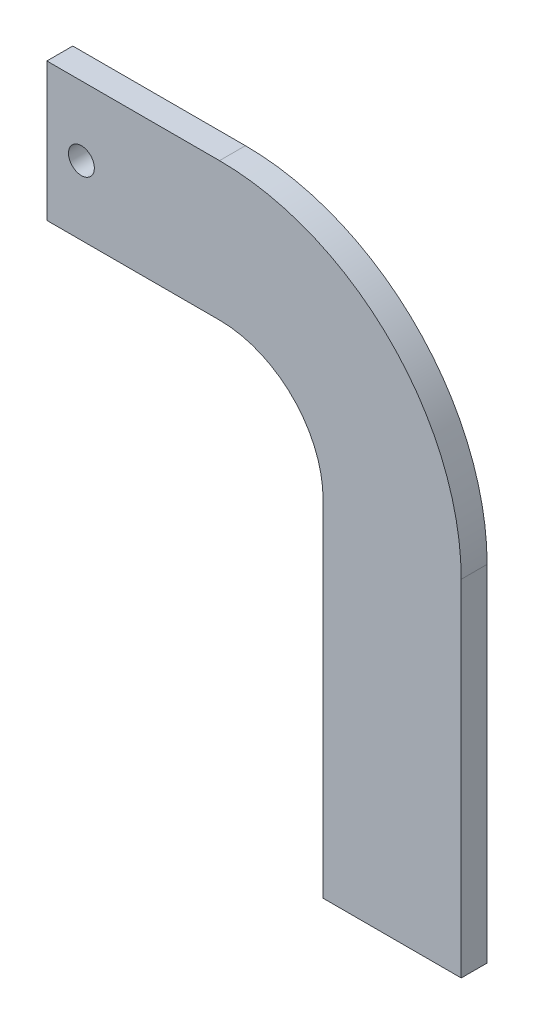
ISO-10303-21;
HEADER;
FILE_DESCRIPTION(('STEP AP214'),'2;1');
FILE_NAME('part.step','',(''),(''),'','','');
FILE_SCHEMA(('AUTOMOTIVE_DESIGN { 1 0 10303 214 1 1 1 1 }'));
ENDSEC;
DATA;
#1=APPLICATION_CONTEXT('core data for automotive mechanical design processes');
#2=APPLICATION_PROTOCOL_DEFINITION('international standard','automotive_design',2000,#1);
#3=PRODUCT_CONTEXT('',#1,'mechanical');
#4=PRODUCT('Part','Part','',(#3));
#5=PRODUCT_RELATED_PRODUCT_CATEGORY('part','',(#4));
#6=PRODUCT_DEFINITION_FORMATION('','',#4);
#7=PRODUCT_DEFINITION_CONTEXT('part definition',#1,'design');
#8=PRODUCT_DEFINITION('design','',#6,#7);
#9=PRODUCT_DEFINITION_SHAPE('','',#8);
#10=(LENGTH_UNIT() NAMED_UNIT(*) SI_UNIT(.MILLI.,.METRE.));
#11=(NAMED_UNIT(*) PLANE_ANGLE_UNIT() SI_UNIT($,.RADIAN.));
#12=(NAMED_UNIT(*) SI_UNIT($,.STERADIAN.) SOLID_ANGLE_UNIT());
#13=UNCERTAINTY_MEASURE_WITH_UNIT(LENGTH_MEASURE(1.E-05),#10,'distance_accuracy_value','');
#14=(GEOMETRIC_REPRESENTATION_CONTEXT(3) GLOBAL_UNCERTAINTY_ASSIGNED_CONTEXT((#13)) GLOBAL_UNIT_ASSIGNED_CONTEXT((#10,
#11,#12)) REPRESENTATION_CONTEXT('',''));
#15=CARTESIAN_POINT('',(0.,0.,0.));
#16=DIRECTION('',(0.,0.,1.));
#17=DIRECTION('',(1.,0.,0.));
#18=AXIS2_PLACEMENT_3D('',#15,#16,#17);
#19=CARTESIAN_POINT('',(-76.2,254.,19.05));
#20=DIRECTION('',(0.,0.,1.));
#21=DIRECTION('',(1.,0.,0.));
#22=AXIS2_PLACEMENT_3D('',#19,#20,#21);
#23=PLANE('',#22);
#24=DIRECTION('',(0.,-1.,0.));
#25=VECTOR('',#24,1.);
#26=CARTESIAN_POINT('',(0.,0.,19.05));
#27=LINE('',#26,#25);
#28=CARTESIAN_POINT('',(0.,254.,19.05));
#29=VERTEX_POINT('',#28);
#30=CARTESIAN_POINT('',(0.,0.,19.05));
#31=VERTEX_POINT('',#30);
#32=EDGE_CURVE('E142',#29,#31,#27,.T.);
#33=ORIENTED_EDGE('',*,*,#32,.T.);
#34=DIRECTION('',(1.,0.,0.));
#35=VECTOR('',#34,1.);
#36=CARTESIAN_POINT('',(0.,0.,19.05));
#37=LINE('',#36,#35);
#38=CARTESIAN_POINT('',(101.6,0.,19.05));
#39=VERTEX_POINT('',#38);
#40=EDGE_CURVE('E90',#31,#39,#37,.T.);
#41=ORIENTED_EDGE('',*,*,#40,.T.);
#42=DIRECTION('',(0.,1.,0.));
#43=VECTOR('',#42,1.);
#44=CARTESIAN_POINT('',(101.6,0.,19.05));
#45=LINE('',#44,#43);
#46=CARTESIAN_POINT('',(101.6,254.,19.05));
#47=VERTEX_POINT('',#46);
#48=EDGE_CURVE('E157',#39,#47,#45,.T.);
#49=ORIENTED_EDGE('',*,*,#48,.T.);
#50=CARTESIAN_POINT('',(-76.2,254.,19.05));
#51=DIRECTION('',(0.,0.,1.));
#52=DIRECTION('',(1.,0.,0.));
#53=AXIS2_PLACEMENT_3D('',#50,#51,#52);
#54=CIRCLE('',#53,177.8);
#55=CARTESIAN_POINT('',(-76.2000000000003,431.8,19.05));
#56=VERTEX_POINT('',#55);
#57=EDGE_CURVE('E170',#47,#56,#54,.T.);
#58=ORIENTED_EDGE('',*,*,#57,.T.);
#59=DIRECTION('',(-1.,0.,0.));
#60=VECTOR('',#59,1.);
#61=CARTESIAN_POINT('',(-203.2,431.8,19.05));
#62=LINE('',#61,#60);
#63=CARTESIAN_POINT('',(-203.2,431.8,19.05));
#64=VERTEX_POINT('',#63);
#65=EDGE_CURVE('E109',#56,#64,#62,.T.);
#66=ORIENTED_EDGE('',*,*,#65,.T.);
#67=DIRECTION('',(0.,-1.,0.));
#68=VECTOR('',#67,1.);
#69=CARTESIAN_POINT('',(-203.2,330.2,19.05));
#70=LINE('',#69,#68);
#71=CARTESIAN_POINT('',(-203.2,330.2,19.05));
#72=VERTEX_POINT('',#71);
#73=EDGE_CURVE('E103',#64,#72,#70,.T.);
#74=ORIENTED_EDGE('',*,*,#73,.T.);
#75=DIRECTION('',(1.,0.,0.));
#76=VECTOR('',#75,1.);
#77=CARTESIAN_POINT('',(-76.2,330.2,19.05));
#78=LINE('',#77,#76);
#79=CARTESIAN_POINT('',(-76.2,330.2,19.05));
#80=VERTEX_POINT('',#79);
#81=EDGE_CURVE('E107',#72,#80,#78,.T.);
#82=ORIENTED_EDGE('',*,*,#81,.T.);
#83=CARTESIAN_POINT('',(-76.2,254.,19.05));
#84=DIRECTION('',(0.,0.,-1.));
#85=DIRECTION('',(1.,0.,0.));
#86=AXIS2_PLACEMENT_3D('',#83,#84,#85);
#87=CIRCLE('',#86,76.2);
#88=EDGE_CURVE('E47',#80,#29,#87,.T.);
#89=ORIENTED_EDGE('',*,*,#88,.T.);
#90=EDGE_LOOP('',(#33,#41,#49,#58,#66,#74,#82,#89));
#91=FACE_BOUND('',#90,.T.);
#92=CARTESIAN_POINT('',(-177.8,381.,19.05));
#93=DIRECTION('',(0.,0.,1.));
#94=DIRECTION('',(1.,0.,0.));
#95=AXIS2_PLACEMENT_3D('',#92,#93,#94);
#96=CIRCLE('',#95,9.52499999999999);
#97=CARTESIAN_POINT('',(-187.325,381.,19.05));
#98=VERTEX_POINT('',#97);
#99=EDGE_CURVE('E131',#98,#98,#96,.T.);
#100=ORIENTED_EDGE('',*,*,#99,.F.);
#101=EDGE_LOOP('',(#100));
#102=FACE_BOUND('',#101,.T.);
#103=ADVANCED_FACE('F30',(#91,#102),#23,.T.);
#104=CARTESIAN_POINT('',(-76.2,254.,0.));
#105=DIRECTION('',(0.,0.,1.));
#106=DIRECTION('',(1.,0.,0.));
#107=AXIS2_PLACEMENT_3D('',#104,#105,#106);
#108=PLANE('',#107);
#109=DIRECTION('',(0.,-1.,0.));
#110=VECTOR('',#109,1.);
#111=CARTESIAN_POINT('',(0.,0.,0.));
#112=LINE('',#111,#110);
#113=CARTESIAN_POINT('',(0.,254.,0.));
#114=VERTEX_POINT('',#113);
#115=CARTESIAN_POINT('',(0.,0.,0.));
#116=VERTEX_POINT('',#115);
#117=EDGE_CURVE('E127',#114,#116,#112,.T.);
#118=ORIENTED_EDGE('',*,*,#117,.F.);
#119=CARTESIAN_POINT('',(-76.2,254.,0.));
#120=DIRECTION('',(0.,0.,-1.));
#121=DIRECTION('',(1.,0.,0.));
#122=AXIS2_PLACEMENT_3D('',#119,#120,#121);
#123=CIRCLE('',#122,76.2);
#124=CARTESIAN_POINT('',(-76.2,330.2,0.));
#125=VERTEX_POINT('',#124);
#126=EDGE_CURVE('E82',#125,#114,#123,.T.);
#127=ORIENTED_EDGE('',*,*,#126,.F.);
#128=DIRECTION('',(1.,0.,0.));
#129=VECTOR('',#128,1.);
#130=CARTESIAN_POINT('',(-76.2,330.2,0.));
#131=LINE('',#130,#129);
#132=CARTESIAN_POINT('',(-203.2,330.2,0.));
#133=VERTEX_POINT('',#132);
#134=EDGE_CURVE('E76',#133,#125,#131,.T.);
#135=ORIENTED_EDGE('',*,*,#134,.F.);
#136=DIRECTION('',(0.,-1.,0.));
#137=VECTOR('',#136,1.);
#138=CARTESIAN_POINT('',(-203.2,330.2,0.));
#139=LINE('',#138,#137);
#140=CARTESIAN_POINT('',(-203.2,431.8,0.));
#141=VERTEX_POINT('',#140);
#142=EDGE_CURVE('E117',#141,#133,#139,.T.);
#143=ORIENTED_EDGE('',*,*,#142,.F.);
#144=DIRECTION('',(-1.,0.,0.));
#145=VECTOR('',#144,1.);
#146=CARTESIAN_POINT('',(-203.2,431.8,0.));
#147=LINE('',#146,#145);
#148=CARTESIAN_POINT('',(-76.2000000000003,431.8,0.));
#149=VERTEX_POINT('',#148);
#150=EDGE_CURVE('E137',#149,#141,#147,.T.);
#151=ORIENTED_EDGE('',*,*,#150,.F.);
#152=CARTESIAN_POINT('',(-76.2,254.,0.));
#153=DIRECTION('',(0.,0.,1.));
#154=DIRECTION('',(1.,0.,0.));
#155=AXIS2_PLACEMENT_3D('',#152,#153,#154);
#156=CIRCLE('',#155,177.8);
#157=CARTESIAN_POINT('',(101.6,254.,0.));
#158=VERTEX_POINT('',#157);
#159=EDGE_CURVE('E135',#158,#149,#156,.T.);
#160=ORIENTED_EDGE('',*,*,#159,.F.);
#161=DIRECTION('',(0.,1.,0.));
#162=VECTOR('',#161,1.);
#163=CARTESIAN_POINT('',(101.6,0.,0.));
#164=LINE('',#163,#162);
#165=CARTESIAN_POINT('',(101.6,0.,0.));
#166=VERTEX_POINT('',#165);
#167=EDGE_CURVE('E133',#166,#158,#164,.T.);
#168=ORIENTED_EDGE('',*,*,#167,.F.);
#169=DIRECTION('',(1.,0.,0.));
#170=VECTOR('',#169,1.);
#171=CARTESIAN_POINT('',(0.,0.,0.));
#172=LINE('',#171,#170);
#173=EDGE_CURVE('E130',#116,#166,#172,.T.);
#174=ORIENTED_EDGE('',*,*,#173,.F.);
#175=EDGE_LOOP('',(#118,#127,#135,#143,#151,#160,#168,#174));
#176=FACE_BOUND('',#175,.T.);
#177=CARTESIAN_POINT('',(-177.8,381.,0.));
#178=DIRECTION('',(0.,0.,1.));
#179=DIRECTION('',(1.,0.,0.));
#180=AXIS2_PLACEMENT_3D('',#177,#178,#179);
#181=CIRCLE('',#180,9.52499999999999);
#182=CARTESIAN_POINT('',(-187.325,381.,0.));
#183=VERTEX_POINT('',#182);
#184=EDGE_CURVE('E176',#183,#183,#181,.T.);
#185=ORIENTED_EDGE('',*,*,#184,.T.);
#186=EDGE_LOOP('',(#185));
#187=FACE_BOUND('',#186,.T.);
#188=ADVANCED_FACE('F161',(#176,#187),#108,.F.);
#189=CARTESIAN_POINT('',(0.,0.,19.05));
#190=DIRECTION('',(1.,0.,0.));
#191=DIRECTION('',(0.,0.,-1.));
#192=AXIS2_PLACEMENT_3D('',#189,#190,#191);
#193=PLANE('',#192);
#194=ORIENTED_EDGE('',*,*,#117,.T.);
#195=DIRECTION('',(0.,0.,-1.));
#196=VECTOR('',#195,1.);
#197=CARTESIAN_POINT('',(0.,0.,19.05));
#198=LINE('',#197,#196);
#199=EDGE_CURVE('E11',#31,#116,#198,.T.);
#200=ORIENTED_EDGE('',*,*,#199,.F.);
#201=ORIENTED_EDGE('',*,*,#32,.F.);
#202=DIRECTION('',(0.,0.,-1.));
#203=VECTOR('',#202,1.);
#204=CARTESIAN_POINT('',(0.,254.,19.05));
#205=LINE('',#204,#203);
#206=EDGE_CURVE('E123',#29,#114,#205,.T.);
#207=ORIENTED_EDGE('',*,*,#206,.T.);
#208=EDGE_LOOP('',(#194,#200,#201,#207));
#209=FACE_BOUND('',#208,.T.);
#210=ADVANCED_FACE('F32',(#209),#193,.F.);
#211=CARTESIAN_POINT('',(0.,0.,19.05));
#212=DIRECTION('',(0.,1.,0.));
#213=DIRECTION('',(0.,0.,1.));
#214=AXIS2_PLACEMENT_3D('',#211,#212,#213);
#215=PLANE('',#214);
#216=ORIENTED_EDGE('',*,*,#173,.T.);
#217=DIRECTION('',(0.,0.,-1.));
#218=VECTOR('',#217,1.);
#219=CARTESIAN_POINT('',(101.6,0.,19.05));
#220=LINE('',#219,#218);
#221=EDGE_CURVE('E39',#39,#166,#220,.T.);
#222=ORIENTED_EDGE('',*,*,#221,.F.);
#223=ORIENTED_EDGE('',*,*,#40,.F.);
#224=ORIENTED_EDGE('',*,*,#199,.T.);
#225=EDGE_LOOP('',(#216,#222,#223,#224));
#226=FACE_BOUND('',#225,.T.);
#227=ADVANCED_FACE('F204',(#226),#215,.F.);
#228=CARTESIAN_POINT('',(101.6,0.,19.05));
#229=DIRECTION('',(-1.,0.,0.));
#230=DIRECTION('',(0.,0.,1.));
#231=AXIS2_PLACEMENT_3D('',#228,#229,#230);
#232=PLANE('',#231);
#233=ORIENTED_EDGE('',*,*,#167,.T.);
#234=DIRECTION('',(0.,0.,-1.));
#235=VECTOR('',#234,1.);
#236=CARTESIAN_POINT('',(101.6,254.,19.05));
#237=LINE('',#236,#235);
#238=EDGE_CURVE('E149',#47,#158,#237,.T.);
#239=ORIENTED_EDGE('',*,*,#238,.F.);
#240=ORIENTED_EDGE('',*,*,#48,.F.);
#241=ORIENTED_EDGE('',*,*,#221,.T.);
#242=EDGE_LOOP('',(#233,#239,#240,#241));
#243=FACE_BOUND('',#242,.T.);
#244=ADVANCED_FACE('F155',(#243),#232,.F.);
#245=CARTESIAN_POINT('',(-76.2,254.,19.05));
#246=DIRECTION('',(0.,0.,-1.));
#247=DIRECTION('',(-1.,0.,0.));
#248=AXIS2_PLACEMENT_3D('',#245,#246,#247);
#249=CYLINDRICAL_SURFACE('',#248,177.8);
#250=ORIENTED_EDGE('',*,*,#159,.T.);
#251=DIRECTION('',(0.,0.,-1.));
#252=VECTOR('',#251,1.);
#253=CARTESIAN_POINT('',(-76.2000000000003,431.8,19.05));
#254=LINE('',#253,#252);
#255=EDGE_CURVE('E146',#56,#149,#254,.T.);
#256=ORIENTED_EDGE('',*,*,#255,.F.);
#257=ORIENTED_EDGE('',*,*,#57,.F.);
#258=ORIENTED_EDGE('',*,*,#238,.T.);
#259=EDGE_LOOP('',(#250,#256,#257,#258));
#260=FACE_BOUND('',#259,.T.);
#261=ADVANCED_FACE('F166',(#260),#249,.T.);
#262=CARTESIAN_POINT('',(-203.2,431.8,19.05));
#263=DIRECTION('',(0.,-1.,0.));
#264=DIRECTION('',(0.,0.,-1.));
#265=AXIS2_PLACEMENT_3D('',#262,#263,#264);
#266=PLANE('',#265);
#267=ORIENTED_EDGE('',*,*,#150,.T.);
#268=DIRECTION('',(0.,0.,-1.));
#269=VECTOR('',#268,1.);
#270=CARTESIAN_POINT('',(-203.2,431.8,19.05));
#271=LINE('',#270,#269);
#272=EDGE_CURVE('E118',#64,#141,#271,.T.);
#273=ORIENTED_EDGE('',*,*,#272,.F.);
#274=ORIENTED_EDGE('',*,*,#65,.F.);
#275=ORIENTED_EDGE('',*,*,#255,.T.);
#276=EDGE_LOOP('',(#267,#273,#274,#275));
#277=FACE_BOUND('',#276,.T.);
#278=ADVANCED_FACE('F169',(#277),#266,.F.);
#279=CARTESIAN_POINT('',(-203.2,330.2,19.05));
#280=DIRECTION('',(1.,0.,0.));
#281=DIRECTION('',(0.,0.,-1.));
#282=AXIS2_PLACEMENT_3D('',#279,#280,#281);
#283=PLANE('',#282);
#284=ORIENTED_EDGE('',*,*,#142,.T.);
#285=DIRECTION('',(0.,0.,-1.));
#286=VECTOR('',#285,1.);
#287=CARTESIAN_POINT('',(-203.2,330.2,19.05));
#288=LINE('',#287,#286);
#289=EDGE_CURVE('E114',#72,#133,#288,.T.);
#290=ORIENTED_EDGE('',*,*,#289,.F.);
#291=ORIENTED_EDGE('',*,*,#73,.F.);
#292=ORIENTED_EDGE('',*,*,#272,.T.);
#293=EDGE_LOOP('',(#284,#290,#291,#292));
#294=FACE_BOUND('',#293,.T.);
#295=ADVANCED_FACE('F115',(#294),#283,.F.);
#296=CARTESIAN_POINT('',(-76.2,330.2,19.05));
#297=DIRECTION('',(0.,1.,0.));
#298=DIRECTION('',(-1.,0.,0.));
#299=AXIS2_PLACEMENT_3D('',#296,#297,#298);
#300=PLANE('',#299);
#301=ORIENTED_EDGE('',*,*,#134,.T.);
#302=DIRECTION('',(0.,0.,-1.));
#303=VECTOR('',#302,1.);
#304=CARTESIAN_POINT('',(-76.2,330.2,19.05));
#305=LINE('',#304,#303);
#306=EDGE_CURVE('E119',#80,#125,#305,.T.);
#307=ORIENTED_EDGE('',*,*,#306,.F.);
#308=ORIENTED_EDGE('',*,*,#81,.F.);
#309=ORIENTED_EDGE('',*,*,#289,.T.);
#310=EDGE_LOOP('',(#301,#307,#308,#309));
#311=FACE_BOUND('',#310,.T.);
#312=ADVANCED_FACE('F121',(#311),#300,.F.);
#313=CARTESIAN_POINT('',(-76.2,254.,19.05));
#314=DIRECTION('',(0.,0.,-1.));
#315=DIRECTION('',(-1.,0.,0.));
#316=AXIS2_PLACEMENT_3D('',#313,#314,#315);
#317=CYLINDRICAL_SURFACE('',#316,76.2);
#318=ORIENTED_EDGE('',*,*,#126,.T.);
#319=ORIENTED_EDGE('',*,*,#206,.F.);
#320=ORIENTED_EDGE('',*,*,#88,.F.);
#321=ORIENTED_EDGE('',*,*,#306,.T.);
#322=EDGE_LOOP('',(#318,#319,#320,#321));
#323=FACE_BOUND('',#322,.T.);
#324=ADVANCED_FACE('F192',(#323),#317,.F.);
#325=CARTESIAN_POINT('',(-177.8,381.,19.05));
#326=DIRECTION('',(0.,0.,-1.));
#327=DIRECTION('',(-1.,0.,0.));
#328=AXIS2_PLACEMENT_3D('',#325,#326,#327);
#329=CYLINDRICAL_SURFACE('',#328,9.52499999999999);
#330=CARTESIAN_POINT('',(-187.325,381.,19.05));
#331=CARTESIAN_POINT('',(-187.325,381.,18.8515625));
#332=CARTESIAN_POINT('',(-187.325,381.,18.653125));
#333=CARTESIAN_POINT('',(-187.325,381.,18.25625));
#334=CARTESIAN_POINT('',(-187.325,381.,18.0578125));
#335=CARTESIAN_POINT('',(-187.325,381.,17.6609375));
#336=CARTESIAN_POINT('',(-187.325,381.,17.4625));
#337=CARTESIAN_POINT('',(-187.325,381.,17.065625));
#338=CARTESIAN_POINT('',(-187.325,381.,16.8671875));
#339=CARTESIAN_POINT('',(-187.325,381.,16.4703125));
#340=CARTESIAN_POINT('',(-187.325,381.,16.271875));
#341=CARTESIAN_POINT('',(-187.325,381.,15.875));
#342=CARTESIAN_POINT('',(-187.325,381.,15.6765625));
#343=CARTESIAN_POINT('',(-187.325,381.,15.2796875));
#344=CARTESIAN_POINT('',(-187.325,381.,15.08125));
#345=CARTESIAN_POINT('',(-187.325,381.,14.684375));
#346=CARTESIAN_POINT('',(-187.325,381.,14.4859375));
#347=CARTESIAN_POINT('',(-187.325,381.,14.0890625));
#348=CARTESIAN_POINT('',(-187.325,381.,13.890625));
#349=CARTESIAN_POINT('',(-187.325,381.,13.49375));
#350=CARTESIAN_POINT('',(-187.325,381.,13.2953125));
#351=CARTESIAN_POINT('',(-187.325,381.,12.8984375));
#352=CARTESIAN_POINT('',(-187.325,381.,12.7));
#353=CARTESIAN_POINT('',(-187.325,381.,12.303125));
#354=CARTESIAN_POINT('',(-187.325,381.,12.1046875));
#355=CARTESIAN_POINT('',(-187.325,381.,11.7078125));
#356=CARTESIAN_POINT('',(-187.325,381.,11.509375));
#357=CARTESIAN_POINT('',(-187.325,381.,11.1125));
#358=CARTESIAN_POINT('',(-187.325,381.,10.9140625));
#359=CARTESIAN_POINT('',(-187.325,381.,10.5171875));
#360=CARTESIAN_POINT('',(-187.325,381.,10.31875));
#361=CARTESIAN_POINT('',(-187.325,381.,9.921875));
#362=CARTESIAN_POINT('',(-187.325,381.,9.7234375));
#363=CARTESIAN_POINT('',(-187.325,381.,9.3265625));
#364=CARTESIAN_POINT('',(-187.325,381.,9.128125));
#365=CARTESIAN_POINT('',(-187.325,381.,8.73125));
#366=CARTESIAN_POINT('',(-187.325,381.,8.5328125));
#367=CARTESIAN_POINT('',(-187.325,381.,8.1359375));
#368=CARTESIAN_POINT('',(-187.325,381.,7.9375));
#369=CARTESIAN_POINT('',(-187.325,381.,7.540625));
#370=CARTESIAN_POINT('',(-187.325,381.,7.3421875));
#371=CARTESIAN_POINT('',(-187.325,381.,6.9453125));
#372=CARTESIAN_POINT('',(-187.325,381.,6.746875));
#373=CARTESIAN_POINT('',(-187.325,381.,6.35));
#374=CARTESIAN_POINT('',(-187.325,381.,6.1515625));
#375=CARTESIAN_POINT('',(-187.325,381.,5.7546875));
#376=CARTESIAN_POINT('',(-187.325,381.,5.55625));
#377=CARTESIAN_POINT('',(-187.325,381.,5.159375));
#378=CARTESIAN_POINT('',(-187.325,381.,4.9609375));
#379=CARTESIAN_POINT('',(-187.325,381.,4.5640625));
#380=CARTESIAN_POINT('',(-187.325,381.,4.365625));
#381=CARTESIAN_POINT('',(-187.325,381.,3.96875));
#382=CARTESIAN_POINT('',(-187.325,381.,3.7703125));
#383=CARTESIAN_POINT('',(-187.325,381.,3.3734375));
#384=CARTESIAN_POINT('',(-187.325,381.,3.175));
#385=CARTESIAN_POINT('',(-187.325,381.,2.778125));
#386=CARTESIAN_POINT('',(-187.325,381.,2.5796875));
#387=CARTESIAN_POINT('',(-187.325,381.,2.1828125));
#388=CARTESIAN_POINT('',(-187.325,381.,1.984375));
#389=CARTESIAN_POINT('',(-187.325,381.,1.5875));
#390=CARTESIAN_POINT('',(-187.325,381.,1.3890625));
#391=CARTESIAN_POINT('',(-187.325,381.,0.992187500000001));
#392=CARTESIAN_POINT('',(-187.325,381.,0.793750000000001));
#393=CARTESIAN_POINT('',(-187.325,381.,0.396875));
#394=CARTESIAN_POINT('',(-187.325,381.,0.1984375));
#395=CARTESIAN_POINT('',(-187.325,381.,0.));
#396=B_SPLINE_CURVE_WITH_KNOTS('',3,(#330,#331,#332,#333,#334,#335,#336,#337,#338,#339,#340,
#341,#342,#343,#344,#345,#346,#347,#348,#349,#350,#351,#352,#353,#354,#355,#356,#357,#358,#359,
#360,#361,#362,#363,#364,#365,#366,#367,#368,#369,#370,#371,#372,#373,#374,#375,#376,#377,#378,
#379,#380,#381,#382,#383,#384,#385,#386,#387,#388,#389,#390,#391,#392,#393,#394,#395),
.UNSPECIFIED.,.F.,.F.,(4,2,2,2,2,2,2,2,2,2,2,2,2,2,2,2,2,2,2,2,2,2,2,2,2,2,2,2,2,2,2,2,4),(0.,
0.5953125,1.190625,1.7859375,2.38125,2.9765625,3.571875,4.1671875,4.7625,5.3578125,5.953125,
6.5484375,7.14375,7.7390625,8.334375,8.9296875,9.525,10.1203125,10.715625,11.3109375,11.90625,
12.5015625,13.096875,13.6921875,14.2875,14.8828125,15.478125,16.0734375,16.66875,17.2640625,
17.859375,18.4546875,19.05),.UNSPECIFIED.);
#397=EDGE_CURVE('BSEAM182',#98,#183,#396,.T.);
#398=ORIENTED_EDGE('',*,*,#99,.T.);
#399=ORIENTED_EDGE('',*,*,#184,.F.);
#400=ORIENTED_EDGE('',*,*,#397,.T.);
#401=ORIENTED_EDGE('',*,*,#397,.F.);
#402=EDGE_LOOP('',(#398,#400,#399,#401));
#403=FACE_BOUND('',#402,.T.);
#404=ADVANCED_FACE('F182',(#403),#329,.F.);
#405=CLOSED_SHELL('',(#103,#188,#210,#227,#244,#261,#278,#295,#312,#324,#404));
#406=MANIFOLD_SOLID_BREP('B2',#405);
#407=ADVANCED_BREP_SHAPE_REPRESENTATION('',(#18,#406),#14);
#408=SHAPE_DEFINITION_REPRESENTATION(#9,#407);
ENDSEC;
END-ISO-10303-21;
